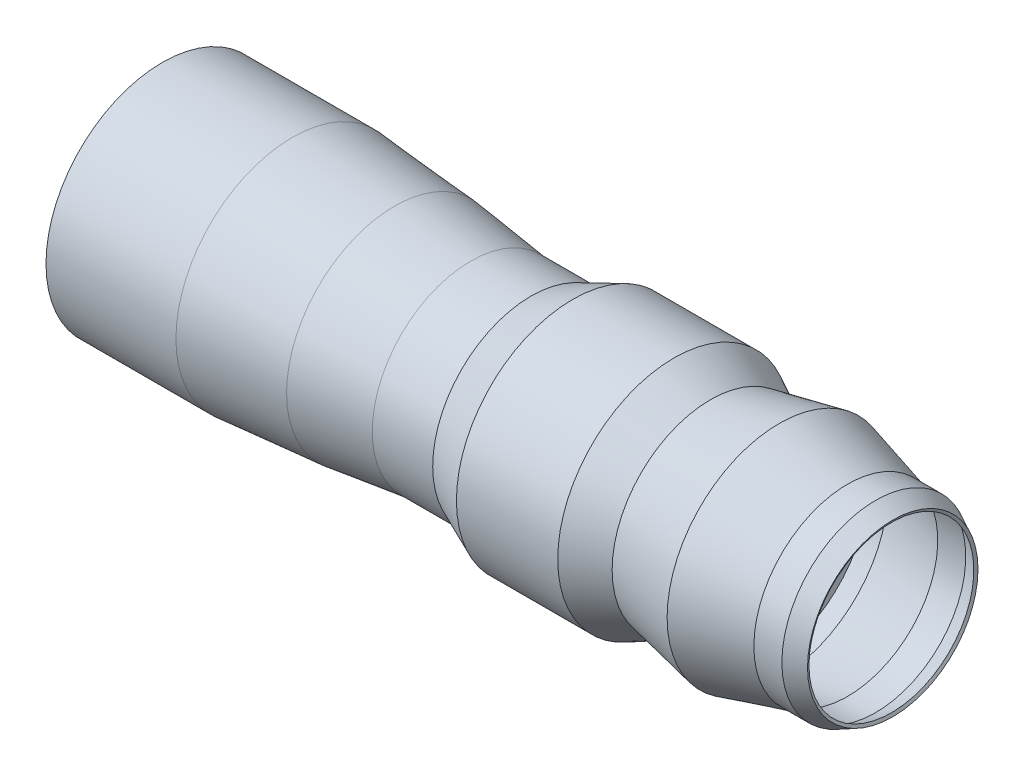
ISO-10303-21;
HEADER;
FILE_DESCRIPTION(('STEP AP214'),'2;1');
FILE_NAME('part.step','',(''),(''),'','','');
FILE_SCHEMA(('AUTOMOTIVE_DESIGN { 1 0 10303 214 1 1 1 1 }'));
ENDSEC;
DATA;
#1=APPLICATION_CONTEXT('core data for automotive mechanical design processes');
#2=APPLICATION_PROTOCOL_DEFINITION('international standard','automotive_design',2000,#1);
#3=PRODUCT_CONTEXT('',#1,'mechanical');
#4=PRODUCT('Part','Part','',(#3));
#5=PRODUCT_RELATED_PRODUCT_CATEGORY('part','',(#4));
#6=PRODUCT_DEFINITION_FORMATION('','',#4);
#7=PRODUCT_DEFINITION_CONTEXT('part definition',#1,'design');
#8=PRODUCT_DEFINITION('design','',#6,#7);
#9=PRODUCT_DEFINITION_SHAPE('','',#8);
#10=(LENGTH_UNIT() NAMED_UNIT(*) SI_UNIT(.MILLI.,.METRE.));
#11=(NAMED_UNIT(*) PLANE_ANGLE_UNIT() SI_UNIT($,.RADIAN.));
#12=(NAMED_UNIT(*) SI_UNIT($,.STERADIAN.) SOLID_ANGLE_UNIT());
#13=UNCERTAINTY_MEASURE_WITH_UNIT(LENGTH_MEASURE(1.E-05),#10,'distance_accuracy_value','');
#14=(GEOMETRIC_REPRESENTATION_CONTEXT(3) GLOBAL_UNCERTAINTY_ASSIGNED_CONTEXT((#13)) GLOBAL_UNIT_ASSIGNED_CONTEXT((#10,
#11,#12)) REPRESENTATION_CONTEXT('',''));
#15=CARTESIAN_POINT('',(0.,0.,0.));
#16=DIRECTION('',(0.,0.,1.));
#17=DIRECTION('',(1.,0.,0.));
#18=AXIS2_PLACEMENT_3D('',#15,#16,#17);
#19=CARTESIAN_POINT('',(21.8151233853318,144.483493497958,0.));
#20=DIRECTION('',(1.,0.,0.));
#21=DIRECTION('',(0.,0.,-1.));
#22=AXIS2_PLACEMENT_3D('',#19,#20,#21);
#23=CONICAL_SURFACE('',#22,13.5002639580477,0.00525352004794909);
#24=CARTESIAN_POINT('',(219.135600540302,144.483493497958,0.));
#25=DIRECTION('',(-1.,0.,0.));
#26=DIRECTION('',(0.,0.,1.));
#27=AXIS2_PLACEMENT_3D('',#24,#25,#26);
#28=CIRCLE('',#27,14.5369005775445);
#29=CARTESIAN_POINT('',(219.135600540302,144.483493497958,14.5369005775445));
#30=VERTEX_POINT('',#29);
#31=EDGE_CURVE('E52',#30,#30,#28,.T.);
#32=ORIENTED_EDGE('',*,*,#31,.F.);
#33=EDGE_LOOP('',(#32));
#34=FACE_BOUND('',#33,.T.);
#35=CARTESIAN_POINT('',(21.8151233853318,144.483493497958,0.));
#36=DIRECTION('',(-1.,0.,0.));
#37=DIRECTION('',(0.,0.,1.));
#38=AXIS2_PLACEMENT_3D('',#35,#36,#37);
#39=CIRCLE('',#38,13.5002639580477);
#40=CARTESIAN_POINT('',(21.8151233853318,144.483493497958,13.5002639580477));
#41=VERTEX_POINT('',#40);
#42=EDGE_CURVE('E11',#41,#41,#39,.T.);
#43=ORIENTED_EDGE('',*,*,#42,.T.);
#44=EDGE_LOOP('',(#43));
#45=FACE_BOUND('',#44,.T.);
#46=ADVANCED_FACE('F38',(#34,#45),#23,.F.);
#47=CARTESIAN_POINT('',(68.0956491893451,144.483493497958,0.));
#48=DIRECTION('',(1.,0.,0.));
#49=DIRECTION('',(0.,0.,-1.));
#50=AXIS2_PLACEMENT_3D('',#47,#48,#49);
#51=CONICAL_SURFACE('',#50,33.4348588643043,0.406717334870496);
#52=ORIENTED_EDGE('',*,*,#42,.F.);
#53=EDGE_LOOP('',(#52));
#54=FACE_BOUND('',#53,.T.);
#55=CARTESIAN_POINT('',(68.0956491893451,144.483493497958,0.));
#56=DIRECTION('',(-1.,0.,0.));
#57=DIRECTION('',(0.,0.,1.));
#58=AXIS2_PLACEMENT_3D('',#55,#56,#57);
#59=CIRCLE('',#58,33.4348588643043);
#60=CARTESIAN_POINT('',(68.0956491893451,144.483493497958,33.4348588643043));
#61=VERTEX_POINT('',#60);
#62=EDGE_CURVE('E44',#61,#61,#59,.T.);
#63=ORIENTED_EDGE('',*,*,#62,.T.);
#64=EDGE_LOOP('',(#63));
#65=FACE_BOUND('',#64,.T.);
#66=ADVANCED_FACE('F61',(#54,#65),#51,.T.);
#67=CARTESIAN_POINT('',(21.8151233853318,144.483493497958,0.));
#68=DIRECTION('',(-1.,0.,0.));
#69=DIRECTION('',(0.,0.,1.));
#70=AXIS2_PLACEMENT_3D('',#67,#68,#69);
#71=CYLINDRICAL_SURFACE('',#70,33.4348588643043);
#72=ORIENTED_EDGE('',*,*,#62,.F.);
#73=EDGE_LOOP('',(#72));
#74=FACE_BOUND('',#73,.T.);
#75=CARTESIAN_POINT('',(180.717843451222,144.483493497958,0.));
#76=DIRECTION('',(-1.,0.,0.));
#77=DIRECTION('',(0.,0.,1.));
#78=AXIS2_PLACEMENT_3D('',#75,#76,#77);
#79=CIRCLE('',#78,33.4348588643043);
#80=CARTESIAN_POINT('',(180.717843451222,144.483493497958,33.4348588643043));
#81=VERTEX_POINT('',#80);
#82=EDGE_CURVE('E48',#81,#81,#79,.T.);
#83=ORIENTED_EDGE('',*,*,#82,.T.);
#84=EDGE_LOOP('',(#83));
#85=FACE_BOUND('',#84,.T.);
#86=ADVANCED_FACE('F65',(#74,#85),#71,.T.);
#87=CARTESIAN_POINT('',(219.135600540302,144.483493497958,0.));
#88=DIRECTION('',(-1.,0.,0.));
#89=DIRECTION('',(0.,0.,1.));
#90=AXIS2_PLACEMENT_3D('',#87,#88,#89);
#91=CONICAL_SURFACE('',#90,14.5369005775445,0.457152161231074);
#92=ORIENTED_EDGE('',*,*,#82,.F.);
#93=EDGE_LOOP('',(#92));
#94=FACE_BOUND('',#93,.T.);
#95=ORIENTED_EDGE('',*,*,#31,.T.);
#96=EDGE_LOOP('',(#95));
#97=FACE_BOUND('',#96,.T.);
#98=ADVANCED_FACE('F58',(#94,#97),#91,.T.);
#99=CLOSED_SHELL('',(#46,#66,#86,#98));
#100=MANIFOLD_SOLID_BREP('B2',#99);
#101=CARTESIAN_POINT('',(219.135600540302,53.9612235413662,0.));
#102=DIRECTION('',(1.,0.,0.));
#103=DIRECTION('',(0.,0.,-1.));
#104=AXIS2_PLACEMENT_3D('',#101,#102,#103);
#105=CONICAL_SURFACE('',#104,105.059170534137,0.197515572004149);
#106=CARTESIAN_POINT('',(255.206858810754,53.9612235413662,0.));
#107=DIRECTION('',(-1.,0.,0.));
#108=DIRECTION('',(0.,0.,1.));
#109=AXIS2_PLACEMENT_3D('',#106,#107,#108);
#110=CIRCLE('',#109,112.277924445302);
#111=CARTESIAN_POINT('',(255.206858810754,53.9612235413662,112.277924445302));
#112=VERTEX_POINT('',#111);
#113=EDGE_CURVE('E152',#112,#112,#110,.F.);
#114=ORIENTED_EDGE('',*,*,#113,.F.);
#115=EDGE_LOOP('',(#114));
#116=FACE_BOUND('',#115,.T.);
#117=CARTESIAN_POINT('',(270.27821743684,53.9612235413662,0.));
#118=DIRECTION('',(1.,0.,0.));
#119=DIRECTION('',(0.,0.,-1.));
#120=AXIS2_PLACEMENT_3D('',#117,#118,#119);
#121=CIRCLE('',#120,115.294077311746);
#122=CARTESIAN_POINT('',(270.27821743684,53.9612235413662,-115.294077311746));
#123=VERTEX_POINT('',#122);
#124=EDGE_CURVE('E143',#123,#123,#121,.F.);
#125=ORIENTED_EDGE('',*,*,#124,.F.);
#126=EDGE_LOOP('',(#125));
#127=FACE_BOUND('',#126,.T.);
#128=ADVANCED_FACE('F99',(#116,#127),#105,.F.);
#129=CARTESIAN_POINT('',(297.635538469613,53.9612235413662,0.));
#130=DIRECTION('',(-1.,0.,0.));
#131=DIRECTION('',(0.,0.,1.));
#132=AXIS2_PLACEMENT_3D('',#129,#130,#131);
#133=CIRCLE('',#132,120.768956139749);
#134=CARTESIAN_POINT('',(297.635538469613,53.9612235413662,120.768956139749));
#135=VERTEX_POINT('',#134);
#136=EDGE_CURVE('E223',#135,#135,#133,.T.);
#137=ORIENTED_EDGE('',*,*,#136,.F.);
#138=EDGE_LOOP('',(#137));
#139=FACE_BOUND('',#138,.T.);
#140=CARTESIAN_POINT('',(280.054233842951,53.9612235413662,0.));
#141=DIRECTION('',(-1.,0.,0.));
#142=DIRECTION('',(0.,0.,1.));
#143=AXIS2_PLACEMENT_3D('',#140,#141,#142);
#144=CIRCLE('',#143,117.250500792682);
#145=CARTESIAN_POINT('',(280.054233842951,53.9612235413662,117.250500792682));
#146=VERTEX_POINT('',#145);
#147=EDGE_CURVE('E146',#146,#146,#144,.F.);
#148=ORIENTED_EDGE('',*,*,#147,.F.);
#149=EDGE_LOOP('',(#148));
#150=FACE_BOUND('',#149,.T.);
#151=ADVANCED_FACE('F302',(#139,#150),#105,.F.);
#152=CARTESIAN_POINT('',(219.135600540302,53.9612235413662,0.));
#153=DIRECTION('',(-1.,0.,0.));
#154=DIRECTION('',(0.,0.,1.));
#155=AXIS2_PLACEMENT_3D('',#152,#153,#154);
#156=CIRCLE('',#155,105.059170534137);
#157=CARTESIAN_POINT('',(219.135600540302,53.9612235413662,105.059170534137));
#158=VERTEX_POINT('',#157);
#159=EDGE_CURVE('E220',#158,#158,#156,.T.);
#160=ORIENTED_EDGE('',*,*,#159,.T.);
#161=EDGE_LOOP('',(#160));
#162=FACE_BOUND('',#161,.T.);
#163=CARTESIAN_POINT('',(245.566620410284,53.9612235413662,0.));
#164=DIRECTION('',(1.,0.,0.));
#165=DIRECTION('',(0.,0.,-1.));
#166=AXIS2_PLACEMENT_3D('',#163,#164,#165);
#167=CIRCLE('',#166,110.348673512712);
#168=CARTESIAN_POINT('',(245.566620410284,53.9612235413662,-110.348673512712));
#169=VERTEX_POINT('',#168);
#170=EDGE_CURVE('E149',#169,#169,#167,.F.);
#171=ORIENTED_EDGE('',*,*,#170,.F.);
#172=EDGE_LOOP('',(#171));
#173=FACE_BOUND('',#172,.T.);
#174=ADVANCED_FACE('F305',(#162,#173),#105,.F.);
#175=CARTESIAN_POINT('',(-129.982595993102,53.9612235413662,0.));
#176=DIRECTION('',(-1.,0.,0.));
#177=DIRECTION('',(0.,0.,1.));
#178=AXIS2_PLACEMENT_3D('',#175,#176,#177);
#179=CONICAL_SURFACE('',#178,114.664030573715,0.125092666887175);
#180=CARTESIAN_POINT('',(-91.5235045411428,53.9612235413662,0.));
#181=DIRECTION('',(-1.,0.,0.));
#182=DIRECTION('',(0.,0.,1.));
#183=AXIS2_PLACEMENT_3D('',#180,#181,#182);
#184=CIRCLE('',#183,109.827827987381);
#185=CARTESIAN_POINT('',(-91.5235045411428,53.9612235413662,109.827827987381));
#186=VERTEX_POINT('',#185);
#187=EDGE_CURVE('E156',#186,#186,#184,.F.);
#188=ORIENTED_EDGE('',*,*,#187,.T.);
#189=EDGE_LOOP('',(#188));
#190=FACE_BOUND('',#189,.T.);
#191=CARTESIAN_POINT('',(-122.530028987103,53.9612235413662,0.));
#192=DIRECTION('',(1.,0.,0.));
#193=DIRECTION('',(0.,0.,-1.));
#194=AXIS2_PLACEMENT_3D('',#191,#192,#193);
#195=CIRCLE('',#194,113.726875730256);
#196=CARTESIAN_POINT('',(-122.530028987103,53.9612235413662,-113.726875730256));
#197=VERTEX_POINT('',#196);
#198=EDGE_CURVE('E168',#197,#197,#195,.F.);
#199=ORIENTED_EDGE('',*,*,#198,.T.);
#200=EDGE_LOOP('',(#199));
#201=FACE_BOUND('',#200,.T.);
#202=ADVANCED_FACE('F314',(#190,#201),#179,.F.);
#203=CARTESIAN_POINT('',(-243.644336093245,53.9612235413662,0.));
#204=DIRECTION('',(-1.,0.,0.));
#205=DIRECTION('',(0.,0.,1.));
#206=AXIS2_PLACEMENT_3D('',#203,#204,#205);
#207=CONICAL_SURFACE('',#206,119.984778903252,0.0467779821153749);
#208=CARTESIAN_POINT('',(-171.099971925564,53.9612235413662,0.));
#209=DIRECTION('',(-1.,0.,0.));
#210=DIRECTION('',(0.,0.,1.));
#211=AXIS2_PLACEMENT_3D('',#208,#209,#210);
#212=CIRCLE('',#211,116.588822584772);
#213=CARTESIAN_POINT('',(-171.099971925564,53.9612235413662,116.588822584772));
#214=VERTEX_POINT('',#213);
#215=EDGE_CURVE('E171',#214,#214,#212,.F.);
#216=ORIENTED_EDGE('',*,*,#215,.T.);
#217=EDGE_LOOP('',(#216));
#218=FACE_BOUND('',#217,.T.);
#219=CARTESIAN_POINT('',(-199.732439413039,53.9612235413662,0.));
#220=DIRECTION('',(1.,0.,0.));
#221=DIRECTION('',(0.,0.,-1.));
#222=AXIS2_PLACEMENT_3D('',#219,#220,#221);
#223=CIRCLE('',#222,117.929169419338);
#224=CARTESIAN_POINT('',(-199.732439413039,53.9612235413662,-117.929169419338));
#225=VERTEX_POINT('',#224);
#226=EDGE_CURVE('E182',#225,#225,#223,.F.);
#227=ORIENTED_EDGE('',*,*,#226,.T.);
#228=EDGE_LOOP('',(#227));
#229=FACE_BOUND('',#228,.T.);
#230=ADVANCED_FACE('F319',(#218,#229),#207,.F.);
#231=CARTESIAN_POINT('',(-210.625225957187,53.9612235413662,0.));
#232=DIRECTION('',(-1.,0.,0.));
#233=DIRECTION('',(0.,0.,1.));
#234=AXIS2_PLACEMENT_3D('',#231,#232,#233);
#235=CIRCLE('',#234,118.439083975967);
#236=CARTESIAN_POINT('',(-210.625225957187,53.9612235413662,118.439083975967));
#237=VERTEX_POINT('',#236);
#238=EDGE_CURVE('E178',#237,#237,#235,.F.);
#239=ORIENTED_EDGE('',*,*,#238,.T.);
#240=EDGE_LOOP('',(#239));
#241=FACE_BOUND('',#240,.T.);
#242=CARTESIAN_POINT('',(-240.65104535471,53.9612235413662,0.));
#243=DIRECTION('',(1.,0.,0.));
#244=DIRECTION('',(0.,0.,-1.));
#245=AXIS2_PLACEMENT_3D('',#242,#243,#244);
#246=CIRCLE('',#245,119.844656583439);
#247=CARTESIAN_POINT('',(-240.65104535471,53.9612235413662,-119.844656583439));
#248=VERTEX_POINT('',#247);
#249=EDGE_CURVE('E189',#248,#248,#246,.F.);
#250=ORIENTED_EDGE('',*,*,#249,.T.);
#251=EDGE_LOOP('',(#250));
#252=FACE_BOUND('',#251,.T.);
#253=ADVANCED_FACE('F728',(#241,#252),#207,.F.);
#254=CARTESIAN_POINT('',(-442.955555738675,53.9612235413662,0.));
#255=DIRECTION('',(-1.,0.,0.));
#256=DIRECTION('',(0.,0.,1.));
#257=AXIS2_PLACEMENT_3D('',#254,#255,#256);
#258=CYLINDRICAL_SURFACE('',#257,119.984778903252);
#259=CARTESIAN_POINT('',(-289.893677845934,53.9612235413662,0.));
#260=DIRECTION('',(-1.,0.,0.));
#261=DIRECTION('',(0.,0.,1.));
#262=AXIS2_PLACEMENT_3D('',#259,#260,#261);
#263=CIRCLE('',#262,119.984778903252);
#264=CARTESIAN_POINT('',(-289.893677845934,53.9612235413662,119.984778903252));
#265=VERTEX_POINT('',#264);
#266=EDGE_CURVE('E192',#265,#265,#263,.F.);
#267=ORIENTED_EDGE('',*,*,#266,.T.);
#268=EDGE_LOOP('',(#267));
#269=FACE_BOUND('',#268,.T.);
#270=CARTESIAN_POINT('',(-321.065619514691,53.9612235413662,0.));
#271=DIRECTION('',(1.,0.,0.));
#272=DIRECTION('',(0.,0.,-1.));
#273=AXIS2_PLACEMENT_3D('',#270,#271,#272);
#274=CIRCLE('',#273,119.984778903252);
#275=CARTESIAN_POINT('',(-321.065619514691,53.9612235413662,-119.984778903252));
#276=VERTEX_POINT('',#275);
#277=EDGE_CURVE('E203',#276,#276,#274,.F.);
#278=ORIENTED_EDGE('',*,*,#277,.T.);
#279=EDGE_LOOP('',(#278));
#280=FACE_BOUND('',#279,.T.);
#281=ADVANCED_FACE('F737',(#269,#280),#258,.F.);
#282=CARTESIAN_POINT('',(-330.552732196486,53.9612235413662,0.));
#283=DIRECTION('',(-1.,0.,0.));
#284=DIRECTION('',(0.,0.,1.));
#285=AXIS2_PLACEMENT_3D('',#282,#283,#284);
#286=CIRCLE('',#285,119.984778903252);
#287=CARTESIAN_POINT('',(-330.552732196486,53.9612235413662,119.984778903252));
#288=VERTEX_POINT('',#287);
#289=EDGE_CURVE('E199',#288,#288,#286,.F.);
#290=ORIENTED_EDGE('',*,*,#289,.T.);
#291=EDGE_LOOP('',(#290));
#292=FACE_BOUND('',#291,.T.);
#293=CARTESIAN_POINT('',(-388.04478578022,53.9612235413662,0.));
#294=DIRECTION('',(-1.,0.,0.));
#295=DIRECTION('',(0.,0.,1.));
#296=AXIS2_PLACEMENT_3D('',#293,#294,#295);
#297=CIRCLE('',#296,119.984778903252);
#298=CARTESIAN_POINT('',(-388.04478578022,53.9612235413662,119.984778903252));
#299=VERTEX_POINT('',#298);
#300=EDGE_CURVE('E155',#299,#299,#297,.T.);
#301=ORIENTED_EDGE('',*,*,#300,.T.);
#302=EDGE_LOOP('',(#301));
#303=FACE_BOUND('',#302,.T.);
#304=ADVANCED_FACE('F738',(#292,#303),#258,.F.);
#305=CARTESIAN_POINT('',(-388.04478578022,183.2391006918,0.));
#306=DIRECTION('',(1.,0.,0.));
#307=DIRECTION('',(0.,0.,-1.));
#308=AXIS2_PLACEMENT_3D('',#305,#306,#307);
#309=PLANE('',#308);
#310=ORIENTED_EDGE('',*,*,#300,.F.);
#311=EDGE_LOOP('',(#310));
#312=FACE_BOUND('',#311,.T.);
#313=CARTESIAN_POINT('',(-388.04478578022,53.9612235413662,0.));
#314=DIRECTION('',(-1.,0.,0.));
#315=DIRECTION('',(0.,0.,1.));
#316=AXIS2_PLACEMENT_3D('',#313,#314,#315);
#317=CIRCLE('',#316,129.277877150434);
#318=CARTESIAN_POINT('',(-388.04478578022,53.9612235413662,129.277877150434));
#319=VERTEX_POINT('',#318);
#320=EDGE_CURVE('E202',#319,#319,#317,.T.);
#321=ORIENTED_EDGE('',*,*,#320,.T.);
#322=EDGE_LOOP('',(#321));
#323=FACE_BOUND('',#322,.T.);
#324=ADVANCED_FACE('F493',(#312,#323),#309,.F.);
#325=CARTESIAN_POINT('',(-250.589925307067,53.9612235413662,0.));
#326=DIRECTION('',(-1.,0.,0.));
#327=DIRECTION('',(0.,0.,1.));
#328=AXIS2_PLACEMENT_3D('',#325,#326,#327);
#329=CIRCLE('',#328,119.984778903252);
#330=CARTESIAN_POINT('',(-250.589925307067,53.9612235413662,119.984778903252));
#331=VERTEX_POINT('',#330);
#332=EDGE_CURVE('E185',#331,#331,#329,.F.);
#333=ORIENTED_EDGE('',*,*,#332,.T.);
#334=EDGE_LOOP('',(#333));
#335=FACE_BOUND('',#334,.T.);
#336=CARTESIAN_POINT('',(-281.310099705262,53.9612235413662,0.));
#337=DIRECTION('',(1.,0.,0.));
#338=DIRECTION('',(0.,0.,-1.));
#339=AXIS2_PLACEMENT_3D('',#336,#337,#338);
#340=CIRCLE('',#339,119.984778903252);
#341=CARTESIAN_POINT('',(-281.310099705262,53.9612235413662,-119.984778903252));
#342=VERTEX_POINT('',#341);
#343=EDGE_CURVE('E196',#342,#342,#340,.F.);
#344=ORIENTED_EDGE('',*,*,#343,.T.);
#345=EDGE_LOOP('',(#344));
#346=FACE_BOUND('',#345,.T.);
#347=ADVANCED_FACE('F725',(#335,#346),#258,.F.);
#348=CARTESIAN_POINT('',(-132.267615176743,53.9612235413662,0.));
#349=DIRECTION('',(-1.,0.,0.));
#350=DIRECTION('',(0.,0.,1.));
#351=AXIS2_PLACEMENT_3D('',#348,#349,#350);
#352=CIRCLE('',#351,114.770997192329);
#353=CARTESIAN_POINT('',(-132.267615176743,53.9612235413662,114.770997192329));
#354=VERTEX_POINT('',#353);
#355=EDGE_CURVE('E164',#354,#354,#352,.F.);
#356=ORIENTED_EDGE('',*,*,#355,.T.);
#357=EDGE_LOOP('',(#356));
#358=FACE_BOUND('',#357,.T.);
#359=CARTESIAN_POINT('',(-160.207185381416,53.9612235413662,0.));
#360=DIRECTION('',(1.,0.,0.));
#361=DIRECTION('',(0.,0.,-1.));
#362=AXIS2_PLACEMENT_3D('',#359,#360,#361);
#363=CIRCLE('',#362,116.078908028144);
#364=CARTESIAN_POINT('',(-160.207185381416,53.9612235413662,-116.078908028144));
#365=VERTEX_POINT('',#364);
#366=EDGE_CURVE('E175',#365,#365,#363,.F.);
#367=ORIENTED_EDGE('',*,*,#366,.T.);
#368=EDGE_LOOP('',(#367));
#369=FACE_BOUND('',#368,.T.);
#370=ADVANCED_FACE('F714',(#358,#369),#207,.F.);
#371=CARTESIAN_POINT('',(-79.7359002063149,53.9612235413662,0.));
#372=DIRECTION('',(1.,0.,0.));
#373=DIRECTION('',(0.,0.,-1.));
#374=AXIS2_PLACEMENT_3D('',#371,#372,#373);
#375=CIRCLE('',#374,108.345545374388);
#376=CARTESIAN_POINT('',(-79.7359002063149,53.9612235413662,-108.345545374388));
#377=VERTEX_POINT('',#376);
#378=EDGE_CURVE('E160',#377,#377,#375,.F.);
#379=ORIENTED_EDGE('',*,*,#378,.T.);
#380=EDGE_LOOP('',(#379));
#381=FACE_BOUND('',#380,.T.);
#382=CARTESIAN_POINT('',(-45.3578752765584,53.9612235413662,0.));
#383=DIRECTION('',(-1.,0.,0.));
#384=DIRECTION('',(0.,0.,1.));
#385=AXIS2_PLACEMENT_3D('',#382,#383,#384);
#386=CIRCLE('',#385,104.02253391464);
#387=CARTESIAN_POINT('',(-45.3578752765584,53.9612235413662,104.02253391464));
#388=VERTEX_POINT('',#387);
#389=EDGE_CURVE('E208',#388,#388,#386,.T.);
#390=ORIENTED_EDGE('',*,*,#389,.F.);
#391=EDGE_LOOP('',(#390));
#392=FACE_BOUND('',#391,.T.);
#393=ADVANCED_FACE('F322',(#381,#392),#179,.F.);
#394=CARTESIAN_POINT('',(-442.955555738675,53.9612235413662,0.));
#395=DIRECTION('',(-1.,0.,0.));
#396=DIRECTION('',(0.,0.,1.));
#397=AXIS2_PLACEMENT_3D('',#394,#395,#396);
#398=CYLINDRICAL_SURFACE('',#397,104.02253391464);
#399=CARTESIAN_POINT('',(21.8151233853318,53.9612235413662,0.));
#400=DIRECTION('',(-1.,0.,0.));
#401=DIRECTION('',(0.,0.,1.));
#402=AXIS2_PLACEMENT_3D('',#399,#400,#401);
#403=CIRCLE('',#402,104.02253391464);
#404=CARTESIAN_POINT('',(21.8151233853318,53.9612235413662,104.02253391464));
#405=VERTEX_POINT('',#404);
#406=EDGE_CURVE('E211',#405,#405,#403,.T.);
#407=ORIENTED_EDGE('',*,*,#406,.F.);
#408=EDGE_LOOP('',(#407));
#409=FACE_BOUND('',#408,.T.);
#410=ORIENTED_EDGE('',*,*,#389,.T.);
#411=EDGE_LOOP('',(#410));
#412=FACE_BOUND('',#411,.T.);
#413=ADVANCED_FACE('F713',(#409,#412),#398,.F.);
#414=CARTESIAN_POINT('',(21.8151233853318,53.9612235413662,0.));
#415=DIRECTION('',(1.,0.,0.));
#416=DIRECTION('',(0.,0.,-1.));
#417=AXIS2_PLACEMENT_3D('',#414,#415,#416);
#418=CONICAL_SURFACE('',#417,104.02253391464,0.406717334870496);
#419=CARTESIAN_POINT('',(68.0956491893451,53.9612235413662,0.));
#420=DIRECTION('',(-1.,0.,0.));
#421=DIRECTION('',(0.,0.,1.));
#422=AXIS2_PLACEMENT_3D('',#419,#420,#421);
#423=CIRCLE('',#422,123.957128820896);
#424=CARTESIAN_POINT('',(68.0956491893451,53.9612235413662,123.957128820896));
#425=VERTEX_POINT('',#424);
#426=EDGE_CURVE('E214',#425,#425,#423,.T.);
#427=ORIENTED_EDGE('',*,*,#426,.F.);
#428=EDGE_LOOP('',(#427));
#429=FACE_BOUND('',#428,.T.);
#430=ORIENTED_EDGE('',*,*,#406,.T.);
#431=EDGE_LOOP('',(#430));
#432=FACE_BOUND('',#431,.T.);
#433=ADVANCED_FACE('F879',(#429,#432),#418,.F.);
#434=CARTESIAN_POINT('',(-442.955555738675,53.9612235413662,0.));
#435=DIRECTION('',(-1.,0.,0.));
#436=DIRECTION('',(0.,0.,1.));
#437=AXIS2_PLACEMENT_3D('',#434,#435,#436);
#438=CYLINDRICAL_SURFACE('',#437,123.957128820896);
#439=CARTESIAN_POINT('',(180.717843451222,53.9612235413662,0.));
#440=DIRECTION('',(-1.,0.,0.));
#441=DIRECTION('',(0.,0.,1.));
#442=AXIS2_PLACEMENT_3D('',#439,#440,#441);
#443=CIRCLE('',#442,123.957128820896);
#444=CARTESIAN_POINT('',(180.717843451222,53.9612235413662,123.957128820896));
#445=VERTEX_POINT('',#444);
#446=EDGE_CURVE('E217',#445,#445,#443,.T.);
#447=ORIENTED_EDGE('',*,*,#446,.F.);
#448=EDGE_LOOP('',(#447));
#449=FACE_BOUND('',#448,.T.);
#450=ORIENTED_EDGE('',*,*,#426,.T.);
#451=EDGE_LOOP('',(#450));
#452=FACE_BOUND('',#451,.T.);
#453=ADVANCED_FACE('F467',(#449,#452),#438,.F.);
#454=CARTESIAN_POINT('',(180.717843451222,53.9612235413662,0.));
#455=DIRECTION('',(-1.,0.,0.));
#456=DIRECTION('',(0.,0.,1.));
#457=AXIS2_PLACEMENT_3D('',#454,#455,#456);
#458=CONICAL_SURFACE('',#457,123.957128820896,0.457152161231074);
#459=ORIENTED_EDGE('',*,*,#159,.F.);
#460=EDGE_LOOP('',(#459));
#461=FACE_BOUND('',#460,.T.);
#462=ORIENTED_EDGE('',*,*,#446,.T.);
#463=EDGE_LOOP('',(#462));
#464=FACE_BOUND('',#463,.T.);
#465=ADVANCED_FACE('F462',(#461,#464),#458,.F.);
#466=CARTESIAN_POINT('',(297.635538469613,53.9612235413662,0.));
#467=DIRECTION('',(-1.,0.,0.));
#468=DIRECTION('',(0.,0.,1.));
#469=AXIS2_PLACEMENT_3D('',#466,#467,#468);
#470=CONICAL_SURFACE('',#469,120.768956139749,0.263735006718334);
#471=CARTESIAN_POINT('',(373.539782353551,53.9612235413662,0.));
#472=DIRECTION('',(-1.,0.,0.));
#473=DIRECTION('',(0.,0.,1.));
#474=AXIS2_PLACEMENT_3D('',#471,#472,#473);
#475=CIRCLE('',#474,100.272923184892);
#476=CARTESIAN_POINT('',(373.539782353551,53.9612235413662,100.272923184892));
#477=VERTEX_POINT('',#476);
#478=EDGE_CURVE('E226',#477,#477,#475,.T.);
#479=ORIENTED_EDGE('',*,*,#478,.F.);
#480=EDGE_LOOP('',(#479));
#481=FACE_BOUND('',#480,.T.);
#482=ORIENTED_EDGE('',*,*,#136,.T.);
#483=EDGE_LOOP('',(#482));
#484=FACE_BOUND('',#483,.T.);
#485=ADVANCED_FACE('F459',(#481,#484),#470,.F.);
#486=CARTESIAN_POINT('',(-442.955555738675,53.9612235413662,0.));
#487=DIRECTION('',(-1.,0.,0.));
#488=DIRECTION('',(0.,0.,1.));
#489=AXIS2_PLACEMENT_3D('',#486,#487,#488);
#490=CYLINDRICAL_SURFACE('',#489,100.272923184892);
#491=CARTESIAN_POINT('',(404.686689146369,53.9612235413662,0.));
#492=DIRECTION('',(-1.,0.,0.));
#493=DIRECTION('',(0.,0.,1.));
#494=AXIS2_PLACEMENT_3D('',#491,#492,#493);
#495=CIRCLE('',#494,100.272923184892);
#496=CARTESIAN_POINT('',(404.686689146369,53.9612235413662,100.272923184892));
#497=VERTEX_POINT('',#496);
#498=EDGE_CURVE('E229',#497,#497,#495,.T.);
#499=ORIENTED_EDGE('',*,*,#498,.F.);
#500=EDGE_LOOP('',(#499));
#501=FACE_BOUND('',#500,.T.);
#502=ORIENTED_EDGE('',*,*,#478,.T.);
#503=EDGE_LOOP('',(#502));
#504=FACE_BOUND('',#503,.T.);
#505=ADVANCED_FACE('F456',(#501,#504),#490,.F.);
#506=CARTESIAN_POINT('',(404.686689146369,53.9612235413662,0.));
#507=DIRECTION('',(-1.,0.,0.));
#508=DIRECTION('',(0.,0.,1.));
#509=AXIS2_PLACEMENT_3D('',#506,#507,#508);
#510=CONICAL_SURFACE('',#509,100.272923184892,0.457152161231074);
#511=CARTESIAN_POINT('',(422.266116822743,53.9612235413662,0.));
#512=DIRECTION('',(-1.,0.,0.));
#513=DIRECTION('',(0.,0.,1.));
#514=AXIS2_PLACEMENT_3D('',#511,#512,#513);
#515=CIRCLE('',#514,91.6254821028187);
#516=CARTESIAN_POINT('',(422.266116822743,53.9612235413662,91.6254821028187));
#517=VERTEX_POINT('',#516);
#518=EDGE_CURVE('E232',#517,#517,#515,.T.);
#519=ORIENTED_EDGE('',*,*,#518,.F.);
#520=EDGE_LOOP('',(#519));
#521=FACE_BOUND('',#520,.T.);
#522=ORIENTED_EDGE('',*,*,#498,.T.);
#523=EDGE_LOOP('',(#522));
#524=FACE_BOUND('',#523,.T.);
#525=ADVANCED_FACE('F452',(#521,#524),#510,.F.);
#526=CARTESIAN_POINT('',(422.266116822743,53.9612235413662,0.));
#527=DIRECTION('',(1.,0.,0.));
#528=DIRECTION('',(0.,0.,-1.));
#529=AXIS2_PLACEMENT_3D('',#526,#527,#528);
#530=CONICAL_SURFACE('',#529,91.6254821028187,1.11364416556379);
#531=CARTESIAN_POINT('',(423.795882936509,53.9612235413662,0.));
#532=DIRECTION('',(-1.,0.,0.));
#533=DIRECTION('',(0.,0.,1.));
#534=AXIS2_PLACEMENT_3D('',#531,#532,#533);
#535=CIRCLE('',#534,94.7353515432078);
#536=CARTESIAN_POINT('',(423.795882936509,53.9612235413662,94.7353515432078));
#537=VERTEX_POINT('',#536);
#538=EDGE_CURVE('E235',#537,#537,#535,.T.);
#539=ORIENTED_EDGE('',*,*,#538,.F.);
#540=EDGE_LOOP('',(#539));
#541=FACE_BOUND('',#540,.T.);
#542=ORIENTED_EDGE('',*,*,#518,.T.);
#543=EDGE_LOOP('',(#542));
#544=FACE_BOUND('',#543,.T.);
#545=ADVANCED_FACE('F448',(#541,#544),#530,.F.);
#546=CARTESIAN_POINT('',(423.795882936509,53.9612235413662,0.));
#547=DIRECTION('',(-1.,0.,0.));
#548=DIRECTION('',(0.,0.,1.));
#549=AXIS2_PLACEMENT_3D('',#546,#547,#548);
#550=CONICAL_SURFACE('',#549,94.7353515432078,0.457152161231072);
#551=CARTESIAN_POINT('',(404.686689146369,53.9612235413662,0.));
#552=DIRECTION('',(-1.,0.,0.));
#553=DIRECTION('',(0.,0.,1.));
#554=AXIS2_PLACEMENT_3D('',#551,#552,#553);
#555=CIRCLE('',#554,104.135295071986);
#556=CARTESIAN_POINT('',(404.686689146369,53.9612235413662,104.135295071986));
#557=VERTEX_POINT('',#556);
#558=EDGE_CURVE('E238',#557,#557,#555,.T.);
#559=ORIENTED_EDGE('',*,*,#558,.F.);
#560=EDGE_LOOP('',(#559));
#561=FACE_BOUND('',#560,.T.);
#562=ORIENTED_EDGE('',*,*,#538,.T.);
#563=EDGE_LOOP('',(#562));
#564=FACE_BOUND('',#563,.T.);
#565=ADVANCED_FACE('F444',(#561,#564),#550,.T.);
#566=CARTESIAN_POINT('',(-442.955555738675,53.9612235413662,0.));
#567=DIRECTION('',(-1.,0.,0.));
#568=DIRECTION('',(0.,0.,1.));
#569=AXIS2_PLACEMENT_3D('',#566,#567,#568);
#570=CYLINDRICAL_SURFACE('',#569,104.135295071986);
#571=CARTESIAN_POINT('',(373.539782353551,53.9612235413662,0.));
#572=DIRECTION('',(-1.,0.,0.));
#573=DIRECTION('',(0.,0.,1.));
#574=AXIS2_PLACEMENT_3D('',#571,#572,#573);
#575=CIRCLE('',#574,104.135295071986);
#576=CARTESIAN_POINT('',(373.539782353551,53.9612235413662,104.135295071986));
#577=VERTEX_POINT('',#576);
#578=EDGE_CURVE('E241',#577,#577,#575,.T.);
#579=ORIENTED_EDGE('',*,*,#578,.F.);
#580=EDGE_LOOP('',(#579));
#581=FACE_BOUND('',#580,.T.);
#582=ORIENTED_EDGE('',*,*,#558,.T.);
#583=EDGE_LOOP('',(#582));
#584=FACE_BOUND('',#583,.T.);
#585=ADVANCED_FACE('F440',(#581,#584),#570,.T.);
#586=CARTESIAN_POINT('',(373.539782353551,53.9612235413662,0.));
#587=DIRECTION('',(-1.,0.,0.));
#588=DIRECTION('',(0.,0.,1.));
#589=AXIS2_PLACEMENT_3D('',#586,#587,#588);
#590=CONICAL_SURFACE('',#589,104.135295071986,0.263735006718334);
#591=CARTESIAN_POINT('',(297.635538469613,53.9612235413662,0.));
#592=DIRECTION('',(-1.,0.,0.));
#593=DIRECTION('',(0.,0.,1.));
#594=AXIS2_PLACEMENT_3D('',#591,#592,#593);
#595=CIRCLE('',#594,124.631328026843);
#596=CARTESIAN_POINT('',(297.635538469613,53.9612235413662,124.631328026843));
#597=VERTEX_POINT('',#596);
#598=EDGE_CURVE('E244',#597,#597,#595,.T.);
#599=ORIENTED_EDGE('',*,*,#598,.F.);
#600=EDGE_LOOP('',(#599));
#601=FACE_BOUND('',#600,.T.);
#602=ORIENTED_EDGE('',*,*,#578,.T.);
#603=EDGE_LOOP('',(#602));
#604=FACE_BOUND('',#603,.T.);
#605=ADVANCED_FACE('F436',(#601,#604),#590,.T.);
#606=CARTESIAN_POINT('',(297.635538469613,53.9612235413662,0.));
#607=DIRECTION('',(1.,0.,0.));
#608=DIRECTION('',(0.,0.,-1.));
#609=AXIS2_PLACEMENT_3D('',#606,#607,#608);
#610=CONICAL_SURFACE('',#609,124.631328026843,0.197515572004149);
#611=CARTESIAN_POINT('',(221.242984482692,53.9612235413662,0.));
#612=DIRECTION('',(-1.,0.,0.));
#613=DIRECTION('',(0.,0.,1.));
#614=AXIS2_PLACEMENT_3D('',#611,#612,#613);
#615=CIRCLE('',#614,109.343282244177);
#616=CARTESIAN_POINT('',(221.242984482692,53.9612235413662,109.343282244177));
#617=VERTEX_POINT('',#616);
#618=EDGE_CURVE('E247',#617,#617,#615,.T.);
#619=ORIENTED_EDGE('',*,*,#618,.F.);
#620=EDGE_LOOP('',(#619));
#621=FACE_BOUND('',#620,.T.);
#622=ORIENTED_EDGE('',*,*,#598,.T.);
#623=EDGE_LOOP('',(#622));
#624=FACE_BOUND('',#623,.T.);
#625=ADVANCED_FACE('F432',(#621,#624),#610,.T.);
#626=CARTESIAN_POINT('',(221.242984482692,53.9612235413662,0.));
#627=DIRECTION('',(-1.,0.,0.));
#628=DIRECTION('',(0.,0.,1.));
#629=AXIS2_PLACEMENT_3D('',#626,#627,#628);
#630=CONICAL_SURFACE('',#629,109.343282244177,0.457152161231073);
#631=CARTESIAN_POINT('',(180.717843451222,53.9612235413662,0.));
#632=DIRECTION('',(-1.,0.,0.));
#633=DIRECTION('',(0.,0.,1.));
#634=AXIS2_PLACEMENT_3D('',#631,#632,#633);
#635=CIRCLE('',#634,129.277877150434);
#636=CARTESIAN_POINT('',(180.717843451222,53.9612235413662,129.277877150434));
#637=VERTEX_POINT('',#636);
#638=EDGE_CURVE('E250',#637,#637,#635,.T.);
#639=ORIENTED_EDGE('',*,*,#638,.F.);
#640=EDGE_LOOP('',(#639));
#641=FACE_BOUND('',#640,.T.);
#642=ORIENTED_EDGE('',*,*,#618,.T.);
#643=EDGE_LOOP('',(#642));
#644=FACE_BOUND('',#643,.T.);
#645=ADVANCED_FACE('F428',(#641,#644),#630,.T.);
#646=CARTESIAN_POINT('',(-442.955555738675,53.9612235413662,0.));
#647=DIRECTION('',(-1.,0.,0.));
#648=DIRECTION('',(0.,0.,1.));
#649=AXIS2_PLACEMENT_3D('',#646,#647,#648);
#650=CYLINDRICAL_SURFACE('',#649,129.277877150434);
#651=CARTESIAN_POINT('',(68.0956491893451,53.9612235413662,0.));
#652=DIRECTION('',(-1.,0.,0.));
#653=DIRECTION('',(0.,0.,1.));
#654=AXIS2_PLACEMENT_3D('',#651,#652,#653);
#655=CIRCLE('',#654,129.277877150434);
#656=CARTESIAN_POINT('',(68.0956491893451,53.9612235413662,129.277877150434));
#657=VERTEX_POINT('',#656);
#658=EDGE_CURVE('E253',#657,#657,#655,.T.);
#659=ORIENTED_EDGE('',*,*,#658,.F.);
#660=EDGE_LOOP('',(#659));
#661=FACE_BOUND('',#660,.T.);
#662=ORIENTED_EDGE('',*,*,#638,.T.);
#663=EDGE_LOOP('',(#662));
#664=FACE_BOUND('',#663,.T.);
#665=ADVANCED_FACE('F424',(#661,#664),#650,.T.);
#666=CARTESIAN_POINT('',(68.0956491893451,53.9612235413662,0.));
#667=DIRECTION('',(1.,0.,0.));
#668=DIRECTION('',(0.,0.,-1.));
#669=AXIS2_PLACEMENT_3D('',#666,#667,#668);
#670=CONICAL_SURFACE('',#669,129.277877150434,0.406717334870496);
#671=CARTESIAN_POINT('',(21.8151233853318,53.9612235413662,0.));
#672=DIRECTION('',(-1.,0.,0.));
#673=DIRECTION('',(0.,0.,1.));
#674=AXIS2_PLACEMENT_3D('',#671,#672,#673);
#675=CIRCLE('',#674,109.343282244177);
#676=CARTESIAN_POINT('',(21.8151233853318,53.9612235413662,109.343282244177));
#677=VERTEX_POINT('',#676);
#678=EDGE_CURVE('E256',#677,#677,#675,.T.);
#679=ORIENTED_EDGE('',*,*,#678,.F.);
#680=EDGE_LOOP('',(#679));
#681=FACE_BOUND('',#680,.T.);
#682=ORIENTED_EDGE('',*,*,#658,.T.);
#683=EDGE_LOOP('',(#682));
#684=FACE_BOUND('',#683,.T.);
#685=ADVANCED_FACE('F420',(#681,#684),#670,.T.);
#686=CARTESIAN_POINT('',(-442.955555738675,53.9612235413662,0.));
#687=DIRECTION('',(-1.,0.,0.));
#688=DIRECTION('',(0.,0.,1.));
#689=AXIS2_PLACEMENT_3D('',#686,#687,#688);
#690=CYLINDRICAL_SURFACE('',#689,109.343282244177);
#691=CARTESIAN_POINT('',(-45.3578752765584,53.9612235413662,0.));
#692=DIRECTION('',(-1.,0.,0.));
#693=DIRECTION('',(0.,0.,1.));
#694=AXIS2_PLACEMENT_3D('',#691,#692,#693);
#695=CIRCLE('',#694,109.343282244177);
#696=CARTESIAN_POINT('',(-45.3578752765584,53.9612235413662,109.343282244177));
#697=VERTEX_POINT('',#696);
#698=EDGE_CURVE('E259',#697,#697,#695,.T.);
#699=ORIENTED_EDGE('',*,*,#698,.F.);
#700=EDGE_LOOP('',(#699));
#701=FACE_BOUND('',#700,.T.);
#702=ORIENTED_EDGE('',*,*,#678,.T.);
#703=EDGE_LOOP('',(#702));
#704=FACE_BOUND('',#703,.T.);
#705=ADVANCED_FACE('F416',(#701,#704),#690,.T.);
#706=CARTESIAN_POINT('',(-45.3578752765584,53.9612235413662,0.));
#707=DIRECTION('',(-1.,0.,0.));
#708=DIRECTION('',(0.,0.,1.));
#709=AXIS2_PLACEMENT_3D('',#706,#707,#708);
#710=CONICAL_SURFACE('',#709,109.343282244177,0.125092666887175);
#711=CARTESIAN_POINT('',(-129.982595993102,53.9612235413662,0.));
#712=DIRECTION('',(-1.,0.,0.));
#713=DIRECTION('',(0.,0.,1.));
#714=AXIS2_PLACEMENT_3D('',#711,#712,#713);
#715=CIRCLE('',#714,119.984778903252);
#716=CARTESIAN_POINT('',(-129.982595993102,53.9612235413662,119.984778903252));
#717=VERTEX_POINT('',#716);
#718=EDGE_CURVE('E262',#717,#717,#715,.T.);
#719=ORIENTED_EDGE('',*,*,#718,.F.);
#720=EDGE_LOOP('',(#719));
#721=FACE_BOUND('',#720,.T.);
#722=ORIENTED_EDGE('',*,*,#698,.T.);
#723=EDGE_LOOP('',(#722));
#724=FACE_BOUND('',#723,.T.);
#725=ADVANCED_FACE('F412',(#721,#724),#710,.T.);
#726=CARTESIAN_POINT('',(-129.982595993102,53.9612235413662,0.));
#727=DIRECTION('',(-1.,0.,0.));
#728=DIRECTION('',(0.,0.,1.));
#729=AXIS2_PLACEMENT_3D('',#726,#727,#728);
#730=CONICAL_SURFACE('',#729,119.984778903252,0.0815795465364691);
#731=CARTESIAN_POINT('',(-243.644336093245,53.9612235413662,0.));
#732=DIRECTION('',(-1.,0.,0.));
#733=DIRECTION('',(0.,0.,1.));
#734=AXIS2_PLACEMENT_3D('',#731,#732,#733);
#735=CIRCLE('',#734,129.277877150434);
#736=CARTESIAN_POINT('',(-243.644336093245,53.9612235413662,129.277877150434));
#737=VERTEX_POINT('',#736);
#738=EDGE_CURVE('E265',#737,#737,#735,.T.);
#739=ORIENTED_EDGE('',*,*,#738,.F.);
#740=EDGE_LOOP('',(#739));
#741=FACE_BOUND('',#740,.T.);
#742=ORIENTED_EDGE('',*,*,#718,.T.);
#743=EDGE_LOOP('',(#742));
#744=FACE_BOUND('',#743,.T.);
#745=ADVANCED_FACE('F408',(#741,#744),#730,.T.);
#746=CARTESIAN_POINT('',(-442.955555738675,53.9612235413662,0.));
#747=DIRECTION('',(-1.,0.,0.));
#748=DIRECTION('',(0.,0.,1.));
#749=AXIS2_PLACEMENT_3D('',#746,#747,#748);
#750=CYLINDRICAL_SURFACE('',#749,129.277877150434);
#751=ORIENTED_EDGE('',*,*,#320,.F.);
#752=EDGE_LOOP('',(#751));
#753=FACE_BOUND('',#752,.T.);
#754=ORIENTED_EDGE('',*,*,#738,.T.);
#755=EDGE_LOOP('',(#754));
#756=FACE_BOUND('',#755,.T.);
#757=ADVANCED_FACE('F404',(#753,#756),#750,.T.);
#758=CARTESIAN_POINT('',(-330.552732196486,177.077360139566,0.));
#759=DIRECTION('',(-1.,0.,0.));
#760=DIRECTION('',(0.,0.,1.));
#761=AXIS2_PLACEMENT_3D('',#758,#759,#760);
#762=PLANE('',#761);
#763=CARTESIAN_POINT('',(-330.552732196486,53.9612235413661,0.));
#764=DIRECTION('',(-1.,0.,0.));
#765=DIRECTION('',(0.,0.,1.));
#766=AXIS2_PLACEMENT_3D('',#763,#764,#765);
#767=CIRCLE('',#766,107.26179000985);
#768=CARTESIAN_POINT('',(-330.552732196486,53.9612235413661,107.26179000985));
#769=VERTEX_POINT('',#768);
#770=EDGE_CURVE('E110',#769,#769,#767,.F.);
#771=ORIENTED_EDGE('',*,*,#770,.T.);
#772=EDGE_LOOP('',(#771));
#773=FACE_BOUND('',#772,.T.);
#774=ORIENTED_EDGE('',*,*,#289,.F.);
#775=EDGE_LOOP('',(#774));
#776=FACE_BOUND('',#775,.T.);
#777=ADVANCED_FACE('F400',(#773,#776),#762,.T.);
#778=CARTESIAN_POINT('',(-321.065619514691,177.077360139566,0.));
#779=DIRECTION('',(1.,0.,0.));
#780=DIRECTION('',(0.,0.,-1.));
#781=AXIS2_PLACEMENT_3D('',#778,#779,#780);
#782=PLANE('',#781);
#783=CARTESIAN_POINT('',(-321.065619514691,53.9612235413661,0.));
#784=DIRECTION('',(1.,0.,0.));
#785=DIRECTION('',(0.,0.,-1.));
#786=AXIS2_PLACEMENT_3D('',#783,#784,#785);
#787=CIRCLE('',#786,97.2749513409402);
#788=CARTESIAN_POINT('',(-321.065619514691,53.9612235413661,-97.2749513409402));
#789=VERTEX_POINT('',#788);
#790=EDGE_CURVE('E195',#789,#789,#787,.T.);
#791=ORIENTED_EDGE('',*,*,#790,.F.);
#792=EDGE_LOOP('',(#791));
#793=FACE_BOUND('',#792,.T.);
#794=ORIENTED_EDGE('',*,*,#277,.F.);
#795=EDGE_LOOP('',(#794));
#796=FACE_BOUND('',#795,.T.);
#797=ADVANCED_FACE('F396',(#793,#796),#782,.T.);
#798=CARTESIAN_POINT('',(-289.893677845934,177.73931068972,0.));
#799=DIRECTION('',(-1.,0.,0.));
#800=DIRECTION('',(0.,0.,1.));
#801=AXIS2_PLACEMENT_3D('',#798,#799,#800);
#802=PLANE('',#801);
#803=CARTESIAN_POINT('',(-289.893677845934,53.9612235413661,0.));
#804=DIRECTION('',(-1.,0.,0.));
#805=DIRECTION('',(0.,0.,1.));
#806=AXIS2_PLACEMENT_3D('',#803,#804,#805);
#807=CIRCLE('',#806,107.174130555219);
#808=CARTESIAN_POINT('',(-289.893677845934,53.9612235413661,107.174130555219));
#809=VERTEX_POINT('',#808);
#810=EDGE_CURVE('E114',#809,#809,#807,.F.);
#811=ORIENTED_EDGE('',*,*,#810,.T.);
#812=EDGE_LOOP('',(#811));
#813=FACE_BOUND('',#812,.T.);
#814=ORIENTED_EDGE('',*,*,#266,.F.);
#815=EDGE_LOOP('',(#814));
#816=FACE_BOUND('',#815,.T.);
#817=ADVANCED_FACE('F392',(#813,#816),#802,.T.);
#818=CARTESIAN_POINT('',(-281.310099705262,177.73931068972,0.));
#819=DIRECTION('',(1.,0.,0.));
#820=DIRECTION('',(0.,0.,-1.));
#821=AXIS2_PLACEMENT_3D('',#818,#819,#820);
#822=PLANE('',#821);
#823=CARTESIAN_POINT('',(-281.310099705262,53.9612235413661,0.));
#824=DIRECTION('',(1.,0.,0.));
#825=DIRECTION('',(0.,0.,-1.));
#826=AXIS2_PLACEMENT_3D('',#823,#824,#825);
#827=CIRCLE('',#826,97.2749513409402);
#828=CARTESIAN_POINT('',(-281.310099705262,53.9612235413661,-97.2749513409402));
#829=VERTEX_POINT('',#828);
#830=EDGE_CURVE('E188',#829,#829,#827,.T.);
#831=ORIENTED_EDGE('',*,*,#830,.F.);
#832=EDGE_LOOP('',(#831));
#833=FACE_BOUND('',#832,.T.);
#834=ORIENTED_EDGE('',*,*,#343,.F.);
#835=EDGE_LOOP('',(#834));
#836=FACE_BOUND('',#835,.T.);
#837=ADVANCED_FACE('F388',(#833,#836),#822,.T.);
#838=CARTESIAN_POINT('',(-250.589925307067,178.764319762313,0.));
#839=DIRECTION('',(-1.,0.,0.));
#840=DIRECTION('',(0.,0.,1.));
#841=AXIS2_PLACEMENT_3D('',#838,#839,#840);
#842=PLANE('',#841);
#843=CARTESIAN_POINT('',(-250.589925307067,53.9612235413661,0.));
#844=DIRECTION('',(-1.,0.,0.));
#845=DIRECTION('',(0.,0.,1.));
#846=AXIS2_PLACEMENT_3D('',#843,#844,#845);
#847=CIRCLE('',#846,107.274764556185);
#848=CARTESIAN_POINT('',(-250.589925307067,53.9612235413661,107.274764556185));
#849=VERTEX_POINT('',#848);
#850=EDGE_CURVE('E119',#849,#849,#847,.F.);
#851=ORIENTED_EDGE('',*,*,#850,.T.);
#852=EDGE_LOOP('',(#851));
#853=FACE_BOUND('',#852,.T.);
#854=ORIENTED_EDGE('',*,*,#332,.F.);
#855=EDGE_LOOP('',(#854));
#856=FACE_BOUND('',#855,.T.);
#857=ADVANCED_FACE('F384',(#853,#856),#842,.T.);
#858=CARTESIAN_POINT('',(-240.65104535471,178.764319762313,0.));
#859=DIRECTION('',(1.,0.,0.));
#860=DIRECTION('',(0.,0.,-1.));
#861=AXIS2_PLACEMENT_3D('',#858,#859,#860);
#862=PLANE('',#861);
#863=CARTESIAN_POINT('',(-240.65104535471,53.9612235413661,0.));
#864=DIRECTION('',(1.,0.,0.));
#865=DIRECTION('',(0.,0.,-1.));
#866=AXIS2_PLACEMENT_3D('',#863,#864,#865);
#867=CIRCLE('',#866,97.2749513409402);
#868=CARTESIAN_POINT('',(-240.65104535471,53.9612235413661,-97.2749513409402));
#869=VERTEX_POINT('',#868);
#870=EDGE_CURVE('E181',#869,#869,#867,.T.);
#871=ORIENTED_EDGE('',*,*,#870,.F.);
#872=EDGE_LOOP('',(#871));
#873=FACE_BOUND('',#872,.T.);
#874=ORIENTED_EDGE('',*,*,#249,.F.);
#875=EDGE_LOOP('',(#874));
#876=FACE_BOUND('',#875,.T.);
#877=ADVANCED_FACE('F380',(#873,#876),#862,.T.);
#878=CARTESIAN_POINT('',(-210.625225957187,174.40803120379,0.));
#879=DIRECTION('',(-1.,0.,0.));
#880=DIRECTION('',(0.,0.,1.));
#881=AXIS2_PLACEMENT_3D('',#878,#879,#880);
#882=PLANE('',#881);
#883=CARTESIAN_POINT('',(-210.625225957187,53.9612235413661,0.));
#884=DIRECTION('',(-1.,0.,0.));
#885=DIRECTION('',(0.,0.,1.));
#886=AXIS2_PLACEMENT_3D('',#883,#884,#885);
#887=CIRCLE('',#886,105.113666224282);
#888=CARTESIAN_POINT('',(-210.625225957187,53.9612235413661,105.113666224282));
#889=VERTEX_POINT('',#888);
#890=EDGE_CURVE('E125',#889,#889,#887,.F.);
#891=ORIENTED_EDGE('',*,*,#890,.T.);
#892=EDGE_LOOP('',(#891));
#893=FACE_BOUND('',#892,.T.);
#894=ORIENTED_EDGE('',*,*,#238,.F.);
#895=EDGE_LOOP('',(#894));
#896=FACE_BOUND('',#895,.T.);
#897=ADVANCED_FACE('F373',(#893,#896),#882,.T.);
#898=CARTESIAN_POINT('',(-199.732439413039,174.40803120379,0.));
#899=DIRECTION('',(1.,0.,0.));
#900=DIRECTION('',(0.,0.,-1.));
#901=AXIS2_PLACEMENT_3D('',#898,#899,#900);
#902=PLANE('',#901);
#903=CARTESIAN_POINT('',(-199.732439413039,53.9612235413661,0.));
#904=DIRECTION('',(1.,0.,0.));
#905=DIRECTION('',(0.,0.,-1.));
#906=AXIS2_PLACEMENT_3D('',#903,#904,#905);
#907=CIRCLE('',#906,95.1136662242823);
#908=CARTESIAN_POINT('',(-199.732439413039,53.9612235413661,-95.1136662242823));
#909=VERTEX_POINT('',#908);
#910=EDGE_CURVE('E174',#909,#909,#907,.T.);
#911=ORIENTED_EDGE('',*,*,#910,.F.);
#912=EDGE_LOOP('',(#911));
#913=FACE_BOUND('',#912,.T.);
#914=ORIENTED_EDGE('',*,*,#226,.F.);
#915=EDGE_LOOP('',(#914));
#916=FACE_BOUND('',#915,.T.);
#917=ADVANCED_FACE('F370',(#913,#916),#902,.T.);
#918=CARTESIAN_POINT('',(-360.261089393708,53.9612235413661,0.));
#919=DIRECTION('',(1.,0.,0.));
#920=DIRECTION('',(0.,0.,-1.));
#921=AXIS2_PLACEMENT_3D('',#918,#919,#920);
#922=CYLINDRICAL_SURFACE('',#921,95.1136662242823);
#923=CARTESIAN_POINT('',(-200.625225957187,53.9612235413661,0.));
#924=DIRECTION('',(-1.,0.,0.));
#925=DIRECTION('',(0.,0.,1.));
#926=AXIS2_PLACEMENT_3D('',#923,#924,#925);
#927=CIRCLE('',#926,95.1136662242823);
#928=CARTESIAN_POINT('',(-200.625225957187,53.9612235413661,95.1136662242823));
#929=VERTEX_POINT('',#928);
#930=EDGE_CURVE('E122',#929,#929,#927,.T.);
#931=ORIENTED_EDGE('',*,*,#930,.T.);
#932=EDGE_LOOP('',(#931));
#933=FACE_BOUND('',#932,.T.);
#934=ORIENTED_EDGE('',*,*,#910,.T.);
#935=EDGE_LOOP('',(#934));
#936=FACE_BOUND('',#935,.T.);
#937=ADVANCED_FACE('F368',(#933,#936),#922,.F.);
#938=CARTESIAN_POINT('',(-171.099971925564,171.845508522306,0.));
#939=DIRECTION('',(-1.,0.,0.));
#940=DIRECTION('',(0.,0.,1.));
#941=AXIS2_PLACEMENT_3D('',#938,#939,#940);
#942=PLANE('',#941);
#943=CARTESIAN_POINT('',(-171.099971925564,53.9612235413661,0.));
#944=DIRECTION('',(-1.,0.,0.));
#945=DIRECTION('',(0.,0.,1.));
#946=AXIS2_PLACEMENT_3D('',#943,#944,#945);
#947=CIRCLE('',#946,105.113666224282);
#948=CARTESIAN_POINT('',(-171.099971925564,53.9612235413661,105.113666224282));
#949=VERTEX_POINT('',#948);
#950=EDGE_CURVE('E131',#949,#949,#947,.F.);
#951=ORIENTED_EDGE('',*,*,#950,.T.);
#952=EDGE_LOOP('',(#951));
#953=FACE_BOUND('',#952,.T.);
#954=ORIENTED_EDGE('',*,*,#215,.F.);
#955=EDGE_LOOP('',(#954));
#956=FACE_BOUND('',#955,.T.);
#957=ADVANCED_FACE('F361',(#953,#956),#942,.T.);
#958=CARTESIAN_POINT('',(-160.207185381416,171.845508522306,0.));
#959=DIRECTION('',(1.,0.,0.));
#960=DIRECTION('',(0.,0.,-1.));
#961=AXIS2_PLACEMENT_3D('',#958,#959,#960);
#962=PLANE('',#961);
#963=CARTESIAN_POINT('',(-160.207185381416,53.9612235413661,0.));
#964=DIRECTION('',(1.,0.,0.));
#965=DIRECTION('',(0.,0.,-1.));
#966=AXIS2_PLACEMENT_3D('',#963,#964,#965);
#967=CIRCLE('',#966,95.1136662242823);
#968=CARTESIAN_POINT('',(-160.207185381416,53.9612235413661,-95.1136662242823));
#969=VERTEX_POINT('',#968);
#970=EDGE_CURVE('E167',#969,#969,#967,.T.);
#971=ORIENTED_EDGE('',*,*,#970,.F.);
#972=EDGE_LOOP('',(#971));
#973=FACE_BOUND('',#972,.T.);
#974=ORIENTED_EDGE('',*,*,#366,.F.);
#975=EDGE_LOOP('',(#974));
#976=FACE_BOUND('',#975,.T.);
#977=ADVANCED_FACE('F358',(#973,#976),#962,.T.);
#978=CARTESIAN_POINT('',(-360.261089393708,53.9612235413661,0.));
#979=DIRECTION('',(1.,0.,0.));
#980=DIRECTION('',(0.,0.,-1.));
#981=AXIS2_PLACEMENT_3D('',#978,#979,#980);
#982=CYLINDRICAL_SURFACE('',#981,95.1136662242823);
#983=CARTESIAN_POINT('',(-161.099971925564,53.9612235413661,0.));
#984=DIRECTION('',(-1.,0.,0.));
#985=DIRECTION('',(0.,0.,1.));
#986=AXIS2_PLACEMENT_3D('',#983,#984,#985);
#987=CIRCLE('',#986,95.1136662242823);
#988=CARTESIAN_POINT('',(-161.099971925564,53.9612235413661,95.1136662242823));
#989=VERTEX_POINT('',#988);
#990=EDGE_CURVE('E128',#989,#989,#987,.T.);
#991=ORIENTED_EDGE('',*,*,#990,.T.);
#992=EDGE_LOOP('',(#991));
#993=FACE_BOUND('',#992,.T.);
#994=ORIENTED_EDGE('',*,*,#970,.T.);
#995=EDGE_LOOP('',(#994));
#996=FACE_BOUND('',#995,.T.);
#997=ADVANCED_FACE('F356',(#993,#996),#982,.F.);
#998=CARTESIAN_POINT('',(-132.267615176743,170.564247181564,0.));
#999=DIRECTION('',(-1.,0.,0.));
#1000=DIRECTION('',(0.,0.,1.));
#1001=AXIS2_PLACEMENT_3D('',#998,#999,#1000);
#1002=PLANE('',#1001);
#1003=CARTESIAN_POINT('',(-132.267615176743,53.9612235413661,0.));
#1004=DIRECTION('',(-1.,0.,0.));
#1005=DIRECTION('',(0.,0.,1.));
#1006=AXIS2_PLACEMENT_3D('',#1003,#1004,#1005);
#1007=CIRCLE('',#1006,105.110222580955);
#1008=CARTESIAN_POINT('',(-132.267615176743,53.9612235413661,105.110222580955));
#1009=VERTEX_POINT('',#1008);
#1010=EDGE_CURVE('E134',#1009,#1009,#1007,.F.);
#1011=ORIENTED_EDGE('',*,*,#1010,.T.);
#1012=EDGE_LOOP('',(#1011));
#1013=FACE_BOUND('',#1012,.T.);
#1014=ORIENTED_EDGE('',*,*,#355,.F.);
#1015=EDGE_LOOP('',(#1014));
#1016=FACE_BOUND('',#1015,.T.);
#1017=ADVANCED_FACE('F352',(#1013,#1016),#1002,.T.);
#1018=CARTESIAN_POINT('',(-122.530028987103,170.564247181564,0.));
#1019=DIRECTION('',(1.,0.,0.));
#1020=DIRECTION('',(0.,0.,-1.));
#1021=AXIS2_PLACEMENT_3D('',#1018,#1019,#1020);
#1022=PLANE('',#1021);
#1023=CARTESIAN_POINT('',(-122.530028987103,53.9612235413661,0.));
#1024=DIRECTION('',(1.,0.,0.));
#1025=DIRECTION('',(0.,0.,-1.));
#1026=AXIS2_PLACEMENT_3D('',#1023,#1024,#1025);
#1027=CIRCLE('',#1026,95.1136662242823);
#1028=CARTESIAN_POINT('',(-122.530028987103,53.9612235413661,-95.1136662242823));
#1029=VERTEX_POINT('',#1028);
#1030=EDGE_CURVE('E159',#1029,#1029,#1027,.T.);
#1031=ORIENTED_EDGE('',*,*,#1030,.F.);
#1032=EDGE_LOOP('',(#1031));
#1033=FACE_BOUND('',#1032,.T.);
#1034=ORIENTED_EDGE('',*,*,#198,.F.);
#1035=EDGE_LOOP('',(#1034));
#1036=FACE_BOUND('',#1035,.T.);
#1037=ADVANCED_FACE('F348',(#1033,#1036),#1022,.T.);
#1038=CARTESIAN_POINT('',(-91.5235045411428,165.695454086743,0.));
#1039=DIRECTION('',(-1.,0.,0.));
#1040=DIRECTION('',(0.,0.,1.));
#1041=AXIS2_PLACEMENT_3D('',#1038,#1039,#1040);
#1042=PLANE('',#1041);
#1043=CARTESIAN_POINT('',(-91.5235045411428,53.9612235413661,0.));
#1044=DIRECTION('',(-1.,0.,0.));
#1045=DIRECTION('',(0.,0.,1.));
#1046=AXIS2_PLACEMENT_3D('',#1043,#1044,#1045);
#1047=CIRCLE('',#1046,98.7154343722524);
#1048=CARTESIAN_POINT('',(-91.5235045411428,53.9612235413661,98.7154343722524));
#1049=VERTEX_POINT('',#1048);
#1050=EDGE_CURVE('E140',#1049,#1049,#1047,.F.);
#1051=ORIENTED_EDGE('',*,*,#1050,.T.);
#1052=EDGE_LOOP('',(#1051));
#1053=FACE_BOUND('',#1052,.T.);
#1054=ORIENTED_EDGE('',*,*,#187,.F.);
#1055=EDGE_LOOP('',(#1054));
#1056=FACE_BOUND('',#1055,.T.);
#1057=ADVANCED_FACE('F343',(#1053,#1056),#1042,.T.);
#1058=CARTESIAN_POINT('',(-79.7359002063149,165.695454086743,0.));
#1059=DIRECTION('',(1.,0.,0.));
#1060=DIRECTION('',(0.,0.,-1.));
#1061=AXIS2_PLACEMENT_3D('',#1058,#1059,#1060);
#1062=PLANE('',#1061);
#1063=CARTESIAN_POINT('',(-79.7359002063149,53.9612235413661,0.));
#1064=DIRECTION('',(1.,0.,0.));
#1065=DIRECTION('',(0.,0.,-1.));
#1066=AXIS2_PLACEMENT_3D('',#1063,#1064,#1065);
#1067=CIRCLE('',#1066,88.7154343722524);
#1068=CARTESIAN_POINT('',(-79.7359002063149,53.9612235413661,-88.7154343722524));
#1069=VERTEX_POINT('',#1068);
#1070=EDGE_CURVE('E163',#1069,#1069,#1067,.T.);
#1071=ORIENTED_EDGE('',*,*,#1070,.F.);
#1072=EDGE_LOOP('',(#1071));
#1073=FACE_BOUND('',#1072,.T.);
#1074=ORIENTED_EDGE('',*,*,#378,.F.);
#1075=EDGE_LOOP('',(#1074));
#1076=FACE_BOUND('',#1075,.T.);
#1077=ADVANCED_FACE('F337',(#1073,#1076),#1062,.T.);
#1078=CARTESIAN_POINT('',(-360.261089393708,53.9612235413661,0.));
#1079=DIRECTION('',(1.,0.,0.));
#1080=DIRECTION('',(0.,0.,-1.));
#1081=AXIS2_PLACEMENT_3D('',#1078,#1079,#1080);
#1082=CYLINDRICAL_SURFACE('',#1081,88.7154343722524);
#1083=CARTESIAN_POINT('',(-81.5235045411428,53.9612235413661,0.));
#1084=DIRECTION('',(-1.,0.,0.));
#1085=DIRECTION('',(0.,0.,1.));
#1086=AXIS2_PLACEMENT_3D('',#1083,#1084,#1085);
#1087=CIRCLE('',#1086,88.7154343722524);
#1088=CARTESIAN_POINT('',(-81.5235045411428,53.9612235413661,88.7154343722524));
#1089=VERTEX_POINT('',#1088);
#1090=EDGE_CURVE('E137',#1089,#1089,#1087,.T.);
#1091=ORIENTED_EDGE('',*,*,#1090,.T.);
#1092=EDGE_LOOP('',(#1091));
#1093=FACE_BOUND('',#1092,.T.);
#1094=ORIENTED_EDGE('',*,*,#1070,.T.);
#1095=EDGE_LOOP('',(#1094));
#1096=FACE_BOUND('',#1095,.T.);
#1097=ADVANCED_FACE('F329',(#1093,#1096),#1082,.F.);
#1098=CARTESIAN_POINT('',(245.566620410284,167.373828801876,0.));
#1099=DIRECTION('',(1.,0.,0.));
#1100=DIRECTION('',(0.,0.,-1.));
#1101=AXIS2_PLACEMENT_3D('',#1098,#1099,#1100);
#1102=PLANE('',#1101);
#1103=CARTESIAN_POINT('',(245.566620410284,53.9612235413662,0.));
#1104=DIRECTION('',(-1.,0.,0.));
#1105=DIRECTION('',(0.,0.,1.));
#1106=AXIS2_PLACEMENT_3D('',#1103,#1104,#1105);
#1107=CIRCLE('',#1106,91.9596803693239);
#1108=CARTESIAN_POINT('',(245.566620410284,53.9612235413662,91.9596803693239));
#1109=VERTEX_POINT('',#1108);
#1110=EDGE_CURVE('E284',#1109,#1109,#1107,.T.);
#1111=ORIENTED_EDGE('',*,*,#1110,.F.);
#1112=EDGE_LOOP('',(#1111));
#1113=FACE_BOUND('',#1112,.T.);
#1114=ORIENTED_EDGE('',*,*,#170,.T.);
#1115=EDGE_LOOP('',(#1114));
#1116=FACE_BOUND('',#1115,.T.);
#1117=ADVANCED_FACE('F327',(#1113,#1116),#1102,.F.);
#1118=CARTESIAN_POINT('',(255.206858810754,167.373828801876,0.));
#1119=DIRECTION('',(-1.,0.,0.));
#1120=DIRECTION('',(0.,0.,1.));
#1121=AXIS2_PLACEMENT_3D('',#1118,#1119,#1120);
#1122=PLANE('',#1121);
#1123=CARTESIAN_POINT('',(255.206858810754,53.9612235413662,0.));
#1124=DIRECTION('',(-1.,0.,0.));
#1125=DIRECTION('',(0.,0.,1.));
#1126=AXIS2_PLACEMENT_3D('',#1123,#1124,#1125);
#1127=CIRCLE('',#1126,101.953206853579);
#1128=CARTESIAN_POINT('',(255.206858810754,53.9612235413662,101.953206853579));
#1129=VERTEX_POINT('',#1128);
#1130=EDGE_CURVE('E106',#1129,#1129,#1127,.T.);
#1131=ORIENTED_EDGE('',*,*,#1130,.T.);
#1132=EDGE_LOOP('',(#1131));
#1133=FACE_BOUND('',#1132,.T.);
#1134=ORIENTED_EDGE('',*,*,#113,.T.);
#1135=EDGE_LOOP('',(#1134));
#1136=FACE_BOUND('',#1135,.T.);
#1137=ADVANCED_FACE('F297',(#1133,#1136),#1122,.F.);
#1138=CARTESIAN_POINT('',(270.27821743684,172.397615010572,0.));
#1139=DIRECTION('',(1.,0.,0.));
#1140=DIRECTION('',(0.,0.,-1.));
#1141=AXIS2_PLACEMENT_3D('',#1138,#1139,#1140);
#1142=PLANE('',#1141);
#1143=CARTESIAN_POINT('',(270.27821743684,53.9612235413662,0.));
#1144=DIRECTION('',(-1.,0.,0.));
#1145=DIRECTION('',(0.,0.,1.));
#1146=AXIS2_PLACEMENT_3D('',#1143,#1144,#1145);
#1147=CIRCLE('',#1146,94.4036844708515);
#1148=CARTESIAN_POINT('',(270.27821743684,53.9612235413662,94.4036844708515));
#1149=VERTEX_POINT('',#1148);
#1150=EDGE_CURVE('E287',#1149,#1149,#1147,.T.);
#1151=ORIENTED_EDGE('',*,*,#1150,.F.);
#1152=EDGE_LOOP('',(#1151));
#1153=FACE_BOUND('',#1152,.T.);
#1154=ORIENTED_EDGE('',*,*,#124,.T.);
#1155=EDGE_LOOP('',(#1154));
#1156=FACE_BOUND('',#1155,.T.);
#1157=ADVANCED_FACE('F293',(#1153,#1156),#1142,.F.);
#1158=CARTESIAN_POINT('',(280.054233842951,172.397615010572,0.));
#1159=DIRECTION('',(-1.,0.,0.));
#1160=DIRECTION('',(0.,0.,1.));
#1161=AXIS2_PLACEMENT_3D('',#1158,#1159,#1160);
#1162=PLANE('',#1161);
#1163=CARTESIAN_POINT('',(280.054233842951,53.9612235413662,0.));
#1164=DIRECTION('',(-1.,0.,0.));
#1165=DIRECTION('',(0.,0.,1.));
#1166=AXIS2_PLACEMENT_3D('',#1163,#1164,#1165);
#1167=CIRCLE('',#1166,104.401175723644);
#1168=CARTESIAN_POINT('',(280.054233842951,53.9612235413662,104.401175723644));
#1169=VERTEX_POINT('',#1168);
#1170=EDGE_CURVE('E37',#1169,#1169,#1167,.T.);
#1171=ORIENTED_EDGE('',*,*,#1170,.T.);
#1172=EDGE_LOOP('',(#1171));
#1173=FACE_BOUND('',#1172,.T.);
#1174=ORIENTED_EDGE('',*,*,#147,.T.);
#1175=EDGE_LOOP('',(#1174));
#1176=FACE_BOUND('',#1175,.T.);
#1177=ADVANCED_FACE('F296',(#1173,#1176),#1162,.F.);
#1178=CARTESIAN_POINT('',(-81.5235045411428,53.9612235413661,0.));
#1179=DIRECTION('',(-1.,0.,0.));
#1180=DIRECTION('',(0.,0.,1.));
#1181=AXIS2_PLACEMENT_3D('',#1178,#1179,#1180);
#1182=TOROIDAL_SURFACE('',#1181,98.7154343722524,10.);
#1183=ORIENTED_EDGE('',*,*,#1090,.F.);
#1184=EDGE_LOOP('',(#1183));
#1185=FACE_BOUND('',#1184,.T.);
#1186=ORIENTED_EDGE('',*,*,#1050,.F.);
#1187=EDGE_LOOP('',(#1186));
#1188=FACE_BOUND('',#1187,.T.);
#1189=ADVANCED_FACE('F476',(#1185,#1188),#1182,.T.);
#1190=CARTESIAN_POINT('',(-122.267615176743,53.9612235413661,0.));
#1191=DIRECTION('',(-1.,0.,0.));
#1192=DIRECTION('',(0.,0.,1.));
#1193=AXIS2_PLACEMENT_3D('',#1190,#1191,#1192);
#1194=TOROIDAL_SURFACE('',#1193,105.110222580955,10.);
#1195=ORIENTED_EDGE('',*,*,#1030,.T.);
#1196=EDGE_LOOP('',(#1195));
#1197=FACE_BOUND('',#1196,.T.);
#1198=ORIENTED_EDGE('',*,*,#1010,.F.);
#1199=EDGE_LOOP('',(#1198));
#1200=FACE_BOUND('',#1199,.T.);
#1201=ADVANCED_FACE('F481',(#1197,#1200),#1194,.T.);
#1202=CARTESIAN_POINT('',(-161.099971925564,53.9612235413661,0.));
#1203=DIRECTION('',(-1.,0.,0.));
#1204=DIRECTION('',(0.,0.,1.));
#1205=AXIS2_PLACEMENT_3D('',#1202,#1203,#1204);
#1206=TOROIDAL_SURFACE('',#1205,105.113666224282,10.);
#1207=ORIENTED_EDGE('',*,*,#990,.F.);
#1208=EDGE_LOOP('',(#1207));
#1209=FACE_BOUND('',#1208,.T.);
#1210=ORIENTED_EDGE('',*,*,#950,.F.);
#1211=EDGE_LOOP('',(#1210));
#1212=FACE_BOUND('',#1211,.T.);
#1213=ADVANCED_FACE('F487',(#1209,#1212),#1206,.T.);
#1214=CARTESIAN_POINT('',(-200.625225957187,53.9612235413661,0.));
#1215=DIRECTION('',(-1.,0.,0.));
#1216=DIRECTION('',(0.,0.,1.));
#1217=AXIS2_PLACEMENT_3D('',#1214,#1215,#1216);
#1218=TOROIDAL_SURFACE('',#1217,105.113666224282,10.);
#1219=ORIENTED_EDGE('',*,*,#930,.F.);
#1220=EDGE_LOOP('',(#1219));
#1221=FACE_BOUND('',#1220,.T.);
#1222=ORIENTED_EDGE('',*,*,#890,.F.);
#1223=EDGE_LOOP('',(#1222));
#1224=FACE_BOUND('',#1223,.T.);
#1225=ADVANCED_FACE('F498',(#1221,#1224),#1218,.T.);
#1226=CARTESIAN_POINT('',(-240.589925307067,53.9612235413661,0.));
#1227=DIRECTION('',(-1.,0.,0.));
#1228=DIRECTION('',(0.,0.,1.));
#1229=AXIS2_PLACEMENT_3D('',#1226,#1227,#1228);
#1230=TOROIDAL_SURFACE('',#1229,107.274764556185,10.);
#1231=ORIENTED_EDGE('',*,*,#870,.T.);
#1232=EDGE_LOOP('',(#1231));
#1233=FACE_BOUND('',#1232,.T.);
#1234=ORIENTED_EDGE('',*,*,#850,.F.);
#1235=EDGE_LOOP('',(#1234));
#1236=FACE_BOUND('',#1235,.T.);
#1237=ADVANCED_FACE('F502',(#1233,#1236),#1230,.T.);
#1238=CARTESIAN_POINT('',(-279.893677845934,53.9612235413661,0.));
#1239=DIRECTION('',(-1.,0.,0.));
#1240=DIRECTION('',(0.,0.,1.));
#1241=AXIS2_PLACEMENT_3D('',#1238,#1239,#1240);
#1242=TOROIDAL_SURFACE('',#1241,107.174130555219,10.);
#1243=ORIENTED_EDGE('',*,*,#830,.T.);
#1244=EDGE_LOOP('',(#1243));
#1245=FACE_BOUND('',#1244,.T.);
#1246=ORIENTED_EDGE('',*,*,#810,.F.);
#1247=EDGE_LOOP('',(#1246));
#1248=FACE_BOUND('',#1247,.T.);
#1249=ADVANCED_FACE('F506',(#1245,#1248),#1242,.T.);
#1250=CARTESIAN_POINT('',(-320.552732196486,53.9612235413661,0.));
#1251=DIRECTION('',(-1.,0.,0.));
#1252=DIRECTION('',(0.,0.,1.));
#1253=AXIS2_PLACEMENT_3D('',#1250,#1251,#1252);
#1254=TOROIDAL_SURFACE('',#1253,107.26179000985,10.);
#1255=ORIENTED_EDGE('',*,*,#790,.T.);
#1256=EDGE_LOOP('',(#1255));
#1257=FACE_BOUND('',#1256,.T.);
#1258=ORIENTED_EDGE('',*,*,#770,.F.);
#1259=EDGE_LOOP('',(#1258));
#1260=FACE_BOUND('',#1259,.T.);
#1261=ADVANCED_FACE('F510',(#1257,#1260),#1254,.T.);
#1262=CARTESIAN_POINT('',(245.206858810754,53.9612235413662,0.));
#1263=DIRECTION('',(-1.,0.,0.));
#1264=DIRECTION('',(0.,0.,1.));
#1265=AXIS2_PLACEMENT_3D('',#1262,#1263,#1264);
#1266=TOROIDAL_SURFACE('',#1265,101.953206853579,10.);
#1267=ORIENTED_EDGE('',*,*,#1110,.T.);
#1268=EDGE_LOOP('',(#1267));
#1269=FACE_BOUND('',#1268,.T.);
#1270=ORIENTED_EDGE('',*,*,#1130,.F.);
#1271=EDGE_LOOP('',(#1270));
#1272=FACE_BOUND('',#1271,.T.);
#1273=ADVANCED_FACE('F513',(#1269,#1272),#1266,.T.);
#1274=CARTESIAN_POINT('',(270.054233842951,53.9612235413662,0.));
#1275=DIRECTION('',(-1.,0.,0.));
#1276=DIRECTION('',(0.,0.,1.));
#1277=AXIS2_PLACEMENT_3D('',#1274,#1275,#1276);
#1278=TOROIDAL_SURFACE('',#1277,104.401175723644,10.);
#1279=ORIENTED_EDGE('',*,*,#1150,.T.);
#1280=EDGE_LOOP('',(#1279));
#1281=FACE_BOUND('',#1280,.T.);
#1282=ORIENTED_EDGE('',*,*,#1170,.F.);
#1283=EDGE_LOOP('',(#1282));
#1284=FACE_BOUND('',#1283,.T.);
#1285=ADVANCED_FACE('F101',(#1281,#1284),#1278,.T.);
#1286=CLOSED_SHELL('',(#128,#151,#174,#202,#230,#253,#281,#304,#324,#347,#370,#393,#413,#433,
#453,#465,#485,#505,#525,#545,#565,#585,#605,#625,#645,#665,#685,#705,#725,#745,#757,#777,#797,
#817,#837,#857,#877,#897,#917,#937,#957,#977,#997,#1017,#1037,#1057,#1077,#1097,#1117,#1137,
#1157,#1177,#1189,#1201,#1213,#1225,#1237,#1249,#1261,#1273,#1285));
#1287=MANIFOLD_SOLID_BREP('B6',#1286);
#1288=ADVANCED_BREP_SHAPE_REPRESENTATION('',(#18,#100,#1287),#14);
#1289=SHAPE_DEFINITION_REPRESENTATION(#9,#1288);
ENDSEC;
END-ISO-10303-21;
